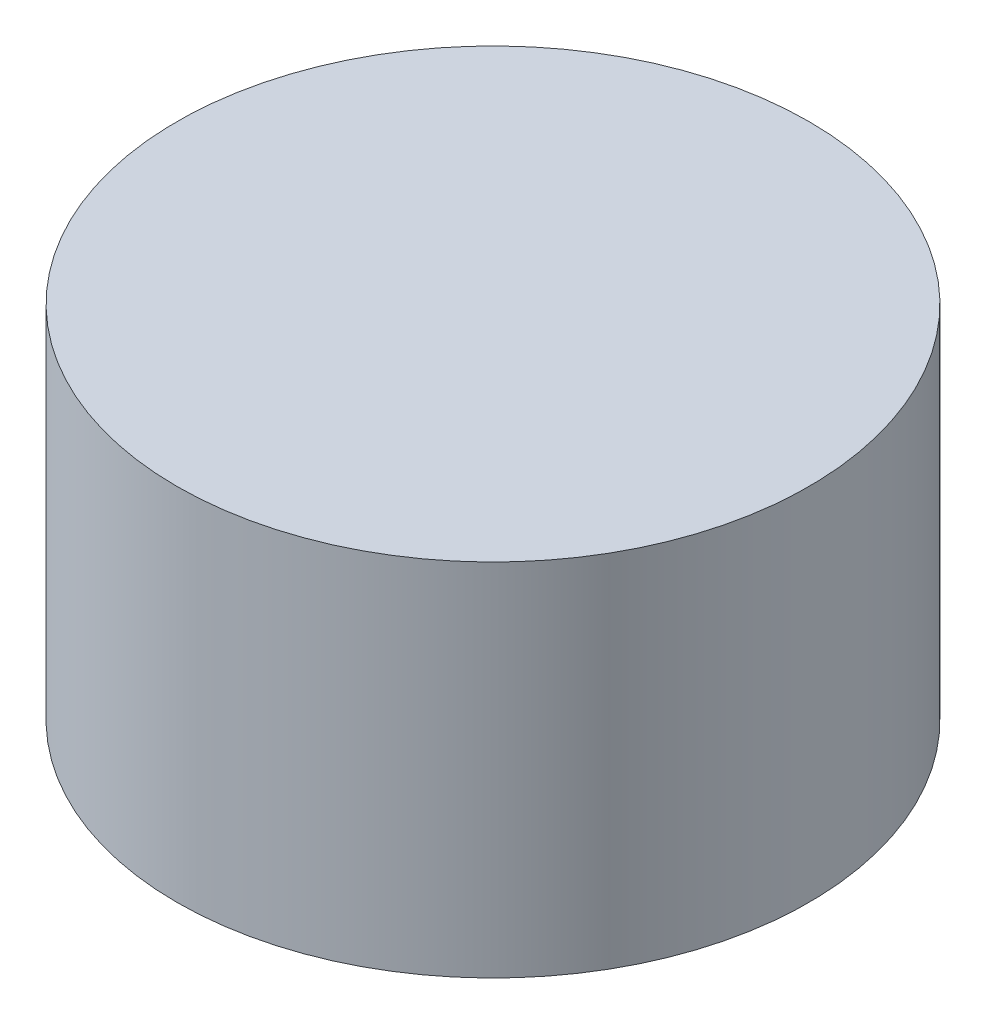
ISO-10303-21;
HEADER;
FILE_DESCRIPTION(('STEP AP214'),'2;1');
FILE_NAME('part.step','',(''),(''),'','','');
FILE_SCHEMA(('AUTOMOTIVE_DESIGN { 1 0 10303 214 1 1 1 1 }'));
ENDSEC;
DATA;
#1=APPLICATION_CONTEXT('core data for automotive mechanical design processes');
#2=APPLICATION_PROTOCOL_DEFINITION('international standard','automotive_design',2000,#1);
#3=PRODUCT_CONTEXT('',#1,'mechanical');
#4=PRODUCT('Part','Part','',(#3));
#5=PRODUCT_RELATED_PRODUCT_CATEGORY('part','',(#4));
#6=PRODUCT_DEFINITION_FORMATION('','',#4);
#7=PRODUCT_DEFINITION_CONTEXT('part definition',#1,'design');
#8=PRODUCT_DEFINITION('design','',#6,#7);
#9=PRODUCT_DEFINITION_SHAPE('','',#8);
#10=(LENGTH_UNIT() NAMED_UNIT(*) SI_UNIT(.MILLI.,.METRE.));
#11=(NAMED_UNIT(*) PLANE_ANGLE_UNIT() SI_UNIT($,.RADIAN.));
#12=(NAMED_UNIT(*) SI_UNIT($,.STERADIAN.) SOLID_ANGLE_UNIT());
#13=UNCERTAINTY_MEASURE_WITH_UNIT(LENGTH_MEASURE(1.E-05),#10,'distance_accuracy_value','');
#14=(GEOMETRIC_REPRESENTATION_CONTEXT(3) GLOBAL_UNCERTAINTY_ASSIGNED_CONTEXT((#13)) GLOBAL_UNIT_ASSIGNED_CONTEXT((#10,
#11,#12)) REPRESENTATION_CONTEXT('',''));
#15=CARTESIAN_POINT('',(0.,0.,0.));
#16=DIRECTION('',(0.,0.,1.));
#17=DIRECTION('',(1.,0.,0.));
#18=AXIS2_PLACEMENT_3D('',#15,#16,#17);
#19=CARTESIAN_POINT('',(0.,0.,0.));
#20=DIRECTION('',(0.,1.,0.));
#21=DIRECTION('',(0.,0.,1.));
#22=AXIS2_PLACEMENT_3D('',#19,#20,#21);
#23=PLANE('',#22);
#24=CARTESIAN_POINT('',(0.,0.,0.));
#25=DIRECTION('',(0.,-1.,0.));
#26=DIRECTION('',(0.,0.,-1.));
#27=AXIS2_PLACEMENT_3D('',#24,#25,#26);
#28=CIRCLE('',#27,7.);
#29=CARTESIAN_POINT('',(0.,0.,-7.));
#30=VERTEX_POINT('',#29);
#31=EDGE_CURVE('E57',#30,#30,#28,.T.);
#32=ORIENTED_EDGE('',*,*,#31,.F.);
#33=EDGE_LOOP('',(#32));
#34=FACE_BOUND('',#33,.T.);
#35=CARTESIAN_POINT('',(0.,0.,0.));
#36=DIRECTION('',(0.,1.,0.));
#37=DIRECTION('',(0.,0.,1.));
#38=AXIS2_PLACEMENT_3D('',#35,#36,#37);
#39=CIRCLE('',#38,12.5);
#40=CARTESIAN_POINT('',(0.,0.,12.5));
#41=VERTEX_POINT('',#40);
#42=EDGE_CURVE('E10',#41,#41,#39,.T.);
#43=ORIENTED_EDGE('',*,*,#42,.F.);
#44=EDGE_LOOP('',(#43));
#45=FACE_BOUND('',#44,.T.);
#46=ADVANCED_FACE('F37',(#34,#45),#23,.F.);
#47=CARTESIAN_POINT('',(0.,13.25,0.));
#48=DIRECTION('',(0.,-1.,0.));
#49=DIRECTION('',(0.,0.,-1.));
#50=AXIS2_PLACEMENT_3D('',#47,#48,#49);
#51=CYLINDRICAL_SURFACE('',#50,12.5);
#52=ORIENTED_EDGE('',*,*,#42,.T.);
#53=EDGE_LOOP('',(#52));
#54=FACE_BOUND('',#53,.T.);
#55=CARTESIAN_POINT('',(0.,14.25,0.));
#56=DIRECTION('',(0.,1.,0.));
#57=DIRECTION('',(0.,0.,1.));
#58=AXIS2_PLACEMENT_3D('',#55,#56,#57);
#59=CIRCLE('',#58,12.5);
#60=CARTESIAN_POINT('',(0.,14.25,12.5));
#61=VERTEX_POINT('',#60);
#62=EDGE_CURVE('E51',#61,#61,#59,.T.);
#63=ORIENTED_EDGE('',*,*,#62,.F.);
#64=EDGE_LOOP('',(#63));
#65=FACE_BOUND('',#64,.T.);
#66=ADVANCED_FACE('F39',(#54,#65),#51,.T.);
#67=CARTESIAN_POINT('',(0.,14.25,0.));
#68=DIRECTION('',(0.,1.,0.));
#69=DIRECTION('',(0.,0.,1.));
#70=AXIS2_PLACEMENT_3D('',#67,#68,#69);
#71=PLANE('',#70);
#72=ORIENTED_EDGE('',*,*,#62,.T.);
#73=EDGE_LOOP('',(#72));
#74=FACE_BOUND('',#73,.T.);
#75=ADVANCED_FACE('F83',(#74),#71,.T.);
#76=CARTESIAN_POINT('',(0.,6.75,0.));
#77=DIRECTION('',(0.,-1.,0.));
#78=DIRECTION('',(0.,0.,-1.));
#79=AXIS2_PLACEMENT_3D('',#76,#77,#78);
#80=CYLINDRICAL_SURFACE('',#79,7.);
#81=CARTESIAN_POINT('',(0.,6.75,0.));
#82=DIRECTION('',(0.,-1.,0.));
#83=DIRECTION('',(0.,0.,-1.));
#84=AXIS2_PLACEMENT_3D('',#81,#82,#83);
#85=CIRCLE('',#84,7.);
#86=CARTESIAN_POINT('',(0.,6.75,-7.));
#87=VERTEX_POINT('',#86);
#88=EDGE_CURVE('E61',#87,#87,#85,.T.);
#89=ORIENTED_EDGE('',*,*,#88,.F.);
#90=EDGE_LOOP('',(#89));
#91=FACE_BOUND('',#90,.T.);
#92=ORIENTED_EDGE('',*,*,#31,.T.);
#93=EDGE_LOOP('',(#92));
#94=FACE_BOUND('',#93,.T.);
#95=ADVANCED_FACE('F75',(#91,#94),#80,.F.);
#96=CARTESIAN_POINT('',(0.,6.75,0.));
#97=DIRECTION('',(0.,-1.,0.));
#98=DIRECTION('',(0.,0.,-1.));
#99=AXIS2_PLACEMENT_3D('',#96,#97,#98);
#100=PLANE('',#99);
#101=CARTESIAN_POINT('',(0.,6.75,0.));
#102=DIRECTION('',(0.,-1.,0.));
#103=DIRECTION('',(0.,0.,-1.));
#104=AXIS2_PLACEMENT_3D('',#101,#102,#103);
#105=CIRCLE('',#104,3.);
#106=CARTESIAN_POINT('',(0.,6.75,-3.));
#107=VERTEX_POINT('',#106);
#108=EDGE_CURVE('E41',#107,#107,#105,.T.);
#109=ORIENTED_EDGE('',*,*,#108,.F.);
#110=EDGE_LOOP('',(#109));
#111=FACE_BOUND('',#110,.T.);
#112=ORIENTED_EDGE('',*,*,#88,.T.);
#113=EDGE_LOOP('',(#112));
#114=FACE_BOUND('',#113,.T.);
#115=ADVANCED_FACE('F72',(#111,#114),#100,.T.);
#116=CARTESIAN_POINT('',(0.,13.25,0.));
#117=DIRECTION('',(0.,1.,0.));
#118=DIRECTION('',(0.,0.,1.));
#119=AXIS2_PLACEMENT_3D('',#116,#117,#118);
#120=PLANE('',#119);
#121=CARTESIAN_POINT('',(0.,13.25,0.));
#122=DIRECTION('',(0.,1.,0.));
#123=DIRECTION('',(0.,0.,1.));
#124=AXIS2_PLACEMENT_3D('',#121,#122,#123);
#125=CIRCLE('',#124,3.);
#126=CARTESIAN_POINT('',(0.,13.25,3.));
#127=VERTEX_POINT('',#126);
#128=EDGE_CURVE('E46',#127,#127,#125,.T.);
#129=ORIENTED_EDGE('',*,*,#128,.F.);
#130=EDGE_LOOP('',(#129));
#131=FACE_BOUND('',#130,.T.);
#132=ADVANCED_FACE('F74',(#131),#120,.F.);
#133=CARTESIAN_POINT('',(0.,13.25,0.));
#134=DIRECTION('',(0.,-1.,0.));
#135=DIRECTION('',(0.,0.,-1.));
#136=AXIS2_PLACEMENT_3D('',#133,#134,#135);
#137=CYLINDRICAL_SURFACE('',#136,3.);
#138=ORIENTED_EDGE('',*,*,#128,.T.);
#139=EDGE_LOOP('',(#138));
#140=FACE_BOUND('',#139,.T.);
#141=ORIENTED_EDGE('',*,*,#108,.T.);
#142=EDGE_LOOP('',(#141));
#143=FACE_BOUND('',#142,.T.);
#144=ADVANCED_FACE('F70',(#140,#143),#137,.F.);
#145=CLOSED_SHELL('',(#46,#66,#75,#95,#115,#132,#144));
#146=MANIFOLD_SOLID_BREP('B2',#145);
#147=ADVANCED_BREP_SHAPE_REPRESENTATION('',(#18,#146),#14);
#148=SHAPE_DEFINITION_REPRESENTATION(#9,#147);
ENDSEC;
END-ISO-10303-21;
